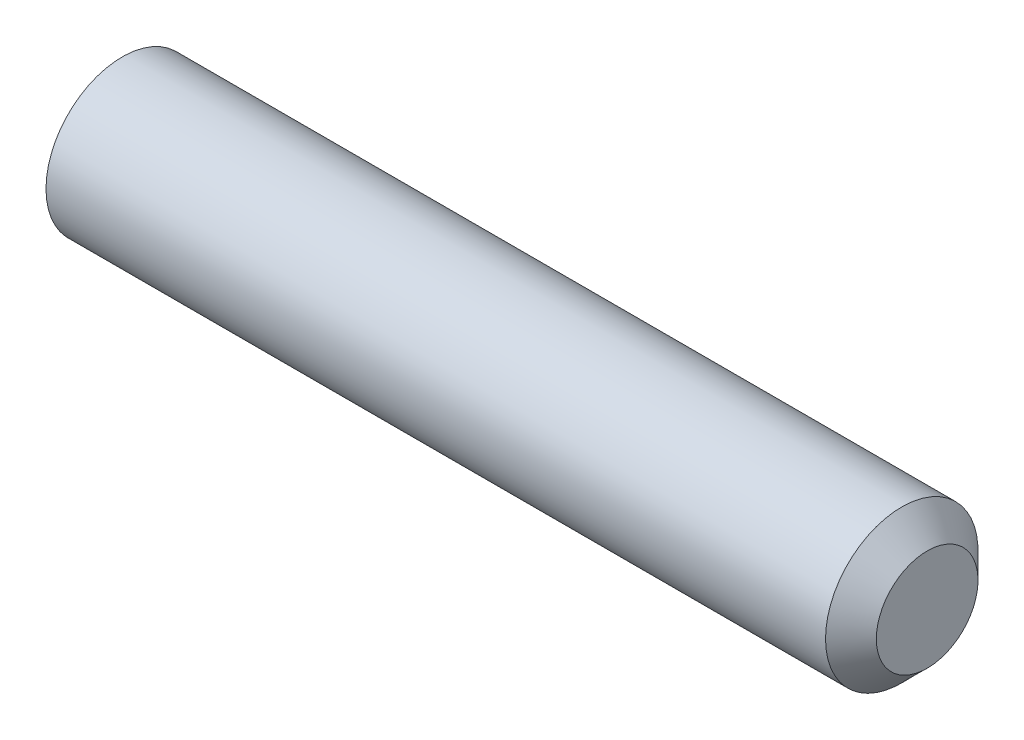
from build123d import *

# Parameters (mm, degrees)
HEX_2_DEPTH = 2


with BuildPart() as part:
    # BodySke → BaseBody (revolve)
    with BuildSketch(Plane.XY, mode=Mode.PRIVATE) as basebody_sk:
        Polygon((0, 0), (0, 1.2195), (0.161946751, 1.5), (15.5, 1.5), (16, 1), (16, 0), align=None)
    revolve(basebody_sk.sketch.rotate(Axis((-12.7, 0, 0), (1, 0, 0)), 90), axis=Axis((-12.7, 0, 0), (1, 0, 0)))

    # Sketch2 → Hex 2 (cut)
    with BuildSketch(Plane.ZY):
        Polygon((0.433012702, 0.75), (-0.433012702, 0.75), (-0.866025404, 0), (-0.433012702, -0.75), (0.433012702, -0.75), (0.866025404, 0), align=None)
    extrude(amount=-HEX_2_DEPTH, mode=Mode.SUBTRACT)


solid = part.part
